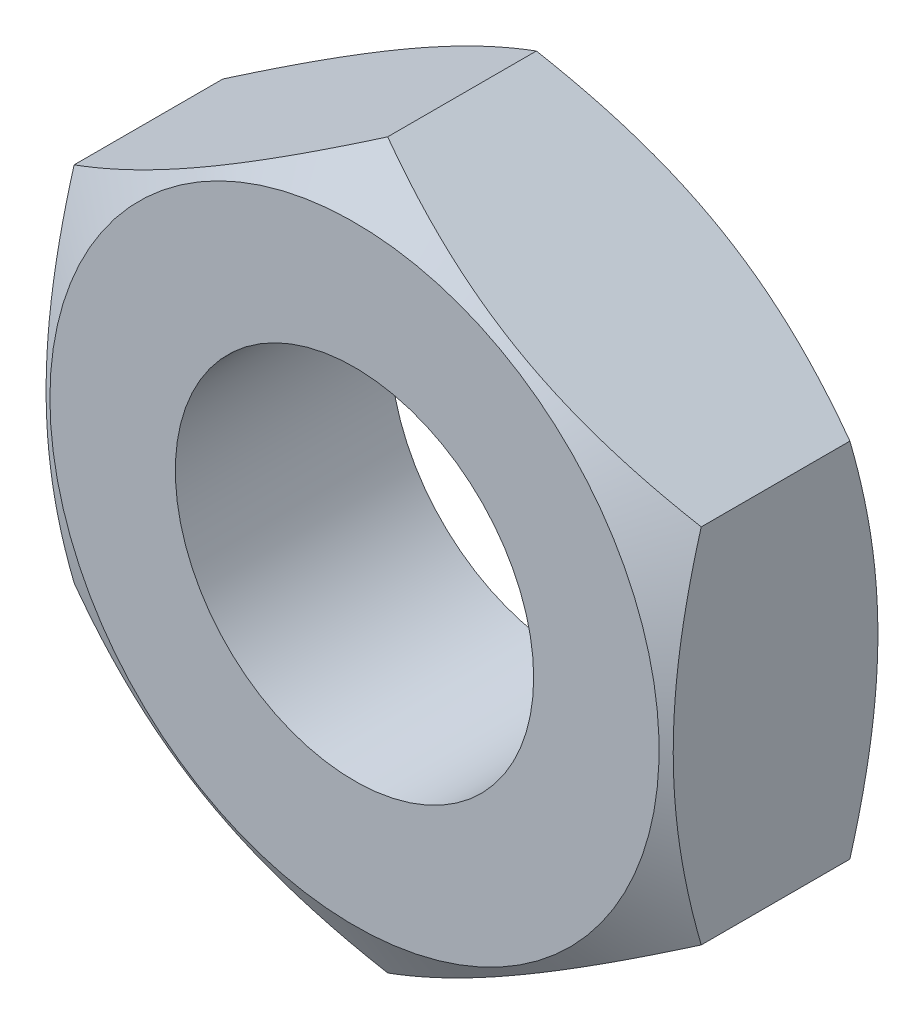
ISO-10303-21;
HEADER;
FILE_DESCRIPTION(('STEP AP214'),'2;1');
FILE_NAME('part.step','',(''),(''),'','','');
FILE_SCHEMA(('AUTOMOTIVE_DESIGN { 1 0 10303 214 1 1 1 1 }'));
ENDSEC;
DATA;
#1=APPLICATION_CONTEXT('core data for automotive mechanical design processes');
#2=APPLICATION_PROTOCOL_DEFINITION('international standard','automotive_design',2000,#1);
#3=PRODUCT_CONTEXT('',#1,'mechanical');
#4=PRODUCT('Part','Part','',(#3));
#5=PRODUCT_RELATED_PRODUCT_CATEGORY('part','',(#4));
#6=PRODUCT_DEFINITION_FORMATION('','',#4);
#7=PRODUCT_DEFINITION_CONTEXT('part definition',#1,'design');
#8=PRODUCT_DEFINITION('design','',#6,#7);
#9=PRODUCT_DEFINITION_SHAPE('','',#8);
#10=(LENGTH_UNIT() NAMED_UNIT(*) SI_UNIT(.MILLI.,.METRE.));
#11=(NAMED_UNIT(*) PLANE_ANGLE_UNIT() SI_UNIT($,.RADIAN.));
#12=(NAMED_UNIT(*) SI_UNIT($,.STERADIAN.) SOLID_ANGLE_UNIT());
#13=UNCERTAINTY_MEASURE_WITH_UNIT(LENGTH_MEASURE(1.E-05),#10,'distance_accuracy_value','');
#14=(GEOMETRIC_REPRESENTATION_CONTEXT(3) GLOBAL_UNCERTAINTY_ASSIGNED_CONTEXT((#13)) GLOBAL_UNIT_ASSIGNED_CONTEXT((#10,
#11,#12)) REPRESENTATION_CONTEXT('',''));
#15=CARTESIAN_POINT('',(0.,0.,0.));
#16=DIRECTION('',(0.,0.,1.));
#17=DIRECTION('',(1.,0.,0.));
#18=AXIS2_PLACEMENT_3D('',#15,#16,#17);
#19=CARTESIAN_POINT('',(0.,4.04145188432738,2.4));
#20=DIRECTION('',(0.,0.,1.));
#21=DIRECTION('',(1.,0.,0.));
#22=AXIS2_PLACEMENT_3D('',#19,#20,#21);
#23=PLANE('',#22);
#24=CARTESIAN_POINT('',(0.,0.,2.4));
#25=DIRECTION('',(0.,0.,-1.));
#26=DIRECTION('',(-1.,0.,0.));
#27=AXIS2_PLACEMENT_3D('',#24,#25,#26);
#28=CIRCLE('',#27,3.4);
#29=CARTESIAN_POINT('',(-3.4,0.,2.4));
#30=VERTEX_POINT('',#29);
#31=EDGE_CURVE('E222',#30,#30,#28,.T.);
#32=ORIENTED_EDGE('',*,*,#31,.F.);
#33=EDGE_LOOP('',(#32));
#34=FACE_BOUND('',#33,.T.);
#35=CARTESIAN_POINT('',(0.,0.,2.4));
#36=DIRECTION('',(0.,0.,1.));
#37=DIRECTION('',(1.,0.,0.));
#38=AXIS2_PLACEMENT_3D('',#35,#36,#37);
#39=CIRCLE('',#38,2.);
#40=CARTESIAN_POINT('',(2.,0.,2.4));
#41=VERTEX_POINT('',#40);
#42=EDGE_CURVE('E93',#41,#41,#39,.T.);
#43=ORIENTED_EDGE('',*,*,#42,.F.);
#44=EDGE_LOOP('',(#43));
#45=FACE_BOUND('',#44,.T.);
#46=ADVANCED_FACE('F14',(#34,#45),#23,.T.);
#47=CARTESIAN_POINT('',(0.,4.04145188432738,0.));
#48=DIRECTION('',(0.,0.,1.));
#49=DIRECTION('',(1.,0.,0.));
#50=AXIS2_PLACEMENT_3D('',#47,#48,#49);
#51=PLANE('',#50);
#52=CARTESIAN_POINT('',(0.,0.,0.));
#53=DIRECTION('',(0.,0.,-1.));
#54=DIRECTION('',(-1.,0.,0.));
#55=AXIS2_PLACEMENT_3D('',#52,#53,#54);
#56=CIRCLE('',#55,3.4);
#57=CARTESIAN_POINT('',(-3.4,0.,0.));
#58=VERTEX_POINT('',#57);
#59=EDGE_CURVE('E86',#58,#58,#56,.T.);
#60=ORIENTED_EDGE('',*,*,#59,.T.);
#61=EDGE_LOOP('',(#60));
#62=FACE_BOUND('',#61,.T.);
#63=CARTESIAN_POINT('',(0.,0.,0.));
#64=DIRECTION('',(0.,0.,1.));
#65=DIRECTION('',(1.,0.,0.));
#66=AXIS2_PLACEMENT_3D('',#63,#64,#65);
#67=CIRCLE('',#66,2.);
#68=CARTESIAN_POINT('',(2.,0.,0.));
#69=VERTEX_POINT('',#68);
#70=EDGE_CURVE('E198',#69,#69,#67,.T.);
#71=ORIENTED_EDGE('',*,*,#70,.T.);
#72=EDGE_LOOP('',(#71));
#73=FACE_BOUND('',#72,.T.);
#74=ADVANCED_FACE('F117',(#62,#73),#51,.F.);
#75=CARTESIAN_POINT('',(3.5,2.02072594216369,2.4));
#76=DIRECTION('',(-0.5,-0.866025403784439,0.));
#77=DIRECTION('',(0.866025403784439,-0.5,0.));
#78=AXIS2_PLACEMENT_3D('',#75,#76,#77);
#79=PLANE('',#78);
#80=DIRECTION('',(0.,0.,-1.));
#81=VECTOR('',#80,1.);
#82=CARTESIAN_POINT('',(3.5,2.02072594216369,2.4));
#83=LINE('',#82,#81);
#84=CARTESIAN_POINT('',(3.5,2.02072594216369,2.0296575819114));
#85=VERTEX_POINT('',#84);
#86=CARTESIAN_POINT('',(3.5,2.02072594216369,0.370342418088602));
#87=VERTEX_POINT('',#86);
#88=EDGE_CURVE('E89',#85,#87,#83,.T.);
#89=ORIENTED_EDGE('',*,*,#88,.T.);
#90=CARTESIAN_POINT('',(3.5002,2.02061047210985,0.37040908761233));
#91=CARTESIAN_POINT('',(3.34639282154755,2.10941108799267,0.319120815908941));
#92=CARTESIAN_POINT('',(3.19125798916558,2.19897822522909,0.272475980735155));
#93=CARTESIAN_POINT('',(2.87830199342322,2.37966345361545,0.191056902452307));
#94=CARTESIAN_POINT('',(2.72047526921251,2.47078475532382,0.15631146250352));
#95=CARTESIAN_POINT('',(2.40677778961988,2.65189807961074,0.102225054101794));
#96=CARTESIAN_POINT('',(2.25095530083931,2.74186223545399,0.082524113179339));
#97=CARTESIAN_POINT('',(1.93857711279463,2.92221386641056,0.0590051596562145));
#98=CARTESIAN_POINT('',(1.78202254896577,3.01260068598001,0.0551676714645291));
#99=CARTESIAN_POINT('',(1.48949078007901,3.1814939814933,0.0631503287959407));
#100=CARTESIAN_POINT('',(1.3534697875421,3.26002573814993,0.0730104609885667));
#101=CARTESIAN_POINT('',(1.08231397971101,3.41657761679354,0.104261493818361));
#102=CARTESIAN_POINT('',(0.947180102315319,3.49459719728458,0.125663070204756));
#103=CARTESIAN_POINT('',(0.675465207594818,3.65147186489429,0.179165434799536));
#104=CARTESIAN_POINT('',(0.538918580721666,3.73030709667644,0.211493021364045));
#105=CARTESIAN_POINT('',(0.2678619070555,3.88680174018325,0.284863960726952));
#106=CARTESIAN_POINT('',(0.133348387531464,3.96446315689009,0.325890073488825));
#107=CARTESIAN_POINT('',(-0.000199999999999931,4.04156735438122,0.37040908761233));
#108=B_SPLINE_CURVE_WITH_KNOTS('',3,(#90,#91,#92,#93,#94,#95,#96,#97,#98,#99,#100,#101,#102,
#103,#104,#105,#106,#107),.UNSPECIFIED.,.F.,.F.,(4,2,2,2,2,2,2,2,4),(0.,0.554793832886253,
1.11092123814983,1.65328467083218,2.19498204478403,2.6666513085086,3.13875761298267,
3.62133612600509,4.10296698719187),.UNSPECIFIED.);
#109=CARTESIAN_POINT('',(0.,4.04145188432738,0.370342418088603));
#110=VERTEX_POINT('',#109);
#111=EDGE_CURVE('E36',#87,#110,#108,.T.);
#112=ORIENTED_EDGE('',*,*,#111,.T.);
#113=DIRECTION('',(0.,0.,-1.));
#114=VECTOR('',#113,1.);
#115=CARTESIAN_POINT('',(0.,4.04145188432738,2.4));
#116=LINE('',#115,#114);
#117=CARTESIAN_POINT('',(0.,4.04145188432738,2.0296575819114));
#118=VERTEX_POINT('',#117);
#119=EDGE_CURVE('E102',#118,#110,#116,.T.);
#120=ORIENTED_EDGE('',*,*,#119,.F.);
#121=CARTESIAN_POINT('',(-0.0002,4.04156735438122,2.02959091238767));
#122=CARTESIAN_POINT('',(0.15360717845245,3.9527667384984,2.08087918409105));
#123=CARTESIAN_POINT('',(0.308742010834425,3.86319960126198,2.12752401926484));
#124=CARTESIAN_POINT('',(0.621698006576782,3.68251437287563,2.20894309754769));
#125=CARTESIAN_POINT('',(0.779524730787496,3.59139307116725,2.24368853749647));
#126=CARTESIAN_POINT('',(1.09322221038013,3.41027974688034,2.2977749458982));
#127=CARTESIAN_POINT('',(1.24904469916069,3.32031559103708,2.31747588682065));
#128=CARTESIAN_POINT('',(1.56142288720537,3.13996396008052,2.34099484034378));
#129=CARTESIAN_POINT('',(1.71797745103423,3.04957714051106,2.34483232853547));
#130=CARTESIAN_POINT('',(2.01050921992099,2.88068384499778,2.33684967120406));
#131=CARTESIAN_POINT('',(2.1465302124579,2.80215208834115,2.32698953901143));
#132=CARTESIAN_POINT('',(2.41768602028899,2.64560020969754,2.29573850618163));
#133=CARTESIAN_POINT('',(2.55281989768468,2.5675806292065,2.27433692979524));
#134=CARTESIAN_POINT('',(2.82453479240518,2.41070596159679,2.22083456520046));
#135=CARTESIAN_POINT('',(2.96108141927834,2.33187072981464,2.18850697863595));
#136=CARTESIAN_POINT('',(3.2321380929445,2.17537608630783,2.11513603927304));
#137=CARTESIAN_POINT('',(3.36665161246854,2.09771466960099,2.07410992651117));
#138=CARTESIAN_POINT('',(3.5002,2.02061047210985,2.02959091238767));
#139=B_SPLINE_CURVE_WITH_KNOTS('',3,(#121,#122,#123,#124,#125,#126,#127,#128,#129,#130,#131,
#132,#133,#134,#135,#136,#137,#138),.UNSPECIFIED.,.F.,.F.,(4,2,2,2,2,2,2,2,4),(0.,
0.554793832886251,1.11092123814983,1.65328467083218,2.19498204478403,2.66665130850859,
3.13875761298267,3.62133612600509,4.10296698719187),.UNSPECIFIED.);
#140=EDGE_CURVE('E186',#118,#85,#139,.T.);
#141=ORIENTED_EDGE('',*,*,#140,.T.);
#142=EDGE_LOOP('',(#89,#112,#120,#141));
#143=FACE_BOUND('',#142,.T.);
#144=ADVANCED_FACE('F16',(#143),#79,.F.);
#145=CARTESIAN_POINT('',(0.,4.04145188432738,2.4));
#146=DIRECTION('',(0.5,-0.866025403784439,0.));
#147=DIRECTION('',(0.866025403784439,0.5,0.));
#148=AXIS2_PLACEMENT_3D('',#145,#146,#147);
#149=PLANE('',#148);
#150=ORIENTED_EDGE('',*,*,#119,.T.);
#151=CARTESIAN_POINT('',(0.000200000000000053,4.04156735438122,0.37040908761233));
#152=CARTESIAN_POINT('',(-0.15360717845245,3.9527667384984,0.319120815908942));
#153=CARTESIAN_POINT('',(-0.308742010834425,3.86319960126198,0.272475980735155));
#154=CARTESIAN_POINT('',(-0.621698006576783,3.68251437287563,0.191056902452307));
#155=CARTESIAN_POINT('',(-0.779524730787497,3.59139307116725,0.15631146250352));
#156=CARTESIAN_POINT('',(-1.09322221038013,3.41027974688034,0.102225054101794));
#157=CARTESIAN_POINT('',(-1.24904469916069,3.32031559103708,0.0825241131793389));
#158=CARTESIAN_POINT('',(-1.56142288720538,3.13996396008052,0.0590051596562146));
#159=CARTESIAN_POINT('',(-1.71797745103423,3.04957714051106,0.0551676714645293));
#160=CARTESIAN_POINT('',(-2.01050921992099,2.88068384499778,0.0631503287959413));
#161=CARTESIAN_POINT('',(-2.14653021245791,2.80215208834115,0.0730104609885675));
#162=CARTESIAN_POINT('',(-2.417686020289,2.64560020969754,0.104261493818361));
#163=CARTESIAN_POINT('',(-2.55281989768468,2.5675806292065,0.125663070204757));
#164=CARTESIAN_POINT('',(-2.82453479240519,2.41070596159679,0.179165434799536));
#165=CARTESIAN_POINT('',(-2.96108141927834,2.33187072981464,0.211493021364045));
#166=CARTESIAN_POINT('',(-3.2321380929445,2.17537608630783,0.284863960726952));
#167=CARTESIAN_POINT('',(-3.36665161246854,2.09771466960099,0.325890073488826));
#168=CARTESIAN_POINT('',(-3.5002,2.02061047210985,0.370409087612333));
#169=B_SPLINE_CURVE_WITH_KNOTS('',3,(#151,#152,#153,#154,#155,#156,#157,#158,#159,#160,#161,
#162,#163,#164,#165,#166,#167,#168),.UNSPECIFIED.,.F.,.F.,(4,2,2,2,2,2,2,2,4),(0.,
0.554793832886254,1.11092123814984,1.65328467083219,2.19498204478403,2.6666513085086,
3.13875761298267,3.6213361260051,4.10296698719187),.UNSPECIFIED.);
#170=CARTESIAN_POINT('',(-3.5,2.02072594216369,0.370342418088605));
#171=VERTEX_POINT('',#170);
#172=EDGE_CURVE('E160',#110,#171,#169,.T.);
#173=ORIENTED_EDGE('',*,*,#172,.T.);
#174=DIRECTION('',(0.,0.,-1.));
#175=VECTOR('',#174,1.);
#176=CARTESIAN_POINT('',(-3.5,2.02072594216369,2.4));
#177=LINE('',#176,#175);
#178=CARTESIAN_POINT('',(-3.5,2.02072594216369,2.0296575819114));
#179=VERTEX_POINT('',#178);
#180=EDGE_CURVE('E99',#179,#171,#177,.T.);
#181=ORIENTED_EDGE('',*,*,#180,.F.);
#182=CARTESIAN_POINT('',(-3.5002,2.02061047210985,2.02959091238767));
#183=CARTESIAN_POINT('',(-3.34639282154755,2.10941108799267,2.08087918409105));
#184=CARTESIAN_POINT('',(-3.19125798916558,2.19897822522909,2.12752401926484));
#185=CARTESIAN_POINT('',(-2.87830199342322,2.37966345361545,2.20894309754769));
#186=CARTESIAN_POINT('',(-2.72047526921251,2.47078475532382,2.24368853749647));
#187=CARTESIAN_POINT('',(-2.40677778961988,2.65189807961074,2.2977749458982));
#188=CARTESIAN_POINT('',(-2.25095530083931,2.74186223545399,2.31747588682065));
#189=CARTESIAN_POINT('',(-1.93857711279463,2.92221386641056,2.34099484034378));
#190=CARTESIAN_POINT('',(-1.78202254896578,3.01260068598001,2.34483232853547));
#191=CARTESIAN_POINT('',(-1.48949078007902,3.1814939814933,2.33684967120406));
#192=CARTESIAN_POINT('',(-1.3534697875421,3.26002573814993,2.32698953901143));
#193=CARTESIAN_POINT('',(-1.08231397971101,3.41657761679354,2.29573850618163));
#194=CARTESIAN_POINT('',(-0.947180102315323,3.49459719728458,2.27433692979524));
#195=CARTESIAN_POINT('',(-0.675465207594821,3.65147186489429,2.22083456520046));
#196=CARTESIAN_POINT('',(-0.538918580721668,3.73030709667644,2.18850697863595));
#197=CARTESIAN_POINT('',(-0.267861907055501,3.88680174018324,2.11513603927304));
#198=CARTESIAN_POINT('',(-0.133348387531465,3.96446315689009,2.07410992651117));
#199=CARTESIAN_POINT('',(0.000200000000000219,4.04156735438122,2.02959091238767));
#200=B_SPLINE_CURVE_WITH_KNOTS('',3,(#182,#183,#184,#185,#186,#187,#188,#189,#190,#191,#192,
#193,#194,#195,#196,#197,#198,#199),.UNSPECIFIED.,.F.,.F.,(4,2,2,2,2,2,2,2,4),(0.,
0.554793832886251,1.11092123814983,1.65328467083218,2.19498204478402,2.66665130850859,
3.13875761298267,3.62133612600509,4.10296698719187),.UNSPECIFIED.);
#201=EDGE_CURVE('E178',#179,#118,#200,.T.);
#202=ORIENTED_EDGE('',*,*,#201,.T.);
#203=EDGE_LOOP('',(#150,#173,#181,#202));
#204=FACE_BOUND('',#203,.T.);
#205=ADVANCED_FACE('F170',(#204),#149,.F.);
#206=CARTESIAN_POINT('',(-3.5,2.02072594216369,2.4));
#207=DIRECTION('',(1.,0.,0.));
#208=DIRECTION('',(0.,1.,0.));
#209=AXIS2_PLACEMENT_3D('',#206,#207,#208);
#210=PLANE('',#209);
#211=ORIENTED_EDGE('',*,*,#180,.T.);
#212=CARTESIAN_POINT('',(-3.5,-5.41189138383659,1.75805590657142));
#213=CARTESIAN_POINT('',(-3.5,-5.25915719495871,1.6840307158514));
#214=CARTESIAN_POINT('',(-3.49999999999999,-5.10607066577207,1.61071996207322));
#215=CARTESIAN_POINT('',(-3.49999999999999,-4.79900549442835,1.46592946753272));
#216=CARTESIAN_POINT('',(-3.49999999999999,-4.64502671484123,1.39445001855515));
#217=CARTESIAN_POINT('',(-3.49999999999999,-4.33518854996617,1.25336122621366));
#218=CARTESIAN_POINT('',(-3.49999999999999,-4.17932347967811,1.18376432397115));
#219=CARTESIAN_POINT('',(-3.49999999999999,-3.86634801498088,1.04744015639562));
#220=CARTESIAN_POINT('',(-3.5,-3.70923768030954,0.980712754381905));
#221=CARTESIAN_POINT('',(-3.5,-3.38851244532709,0.8488257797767));
#222=CARTESIAN_POINT('',(-3.5,-3.22484925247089,0.783783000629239));
#223=CARTESIAN_POINT('',(-3.5,-2.89560216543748,0.658659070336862));
#224=CARTESIAN_POINT('',(-3.5,-2.73001805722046,0.598578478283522));
#225=CARTESIAN_POINT('',(-3.5,-2.39698090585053,0.484967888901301));
#226=CARTESIAN_POINT('',(-3.5,-2.22953248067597,0.431424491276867));
#227=CARTESIAN_POINT('',(-3.5,-1.89223377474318,0.33261702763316));
#228=CARTESIAN_POINT('',(-3.5,-1.72238427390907,0.287350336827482));
#229=CARTESIAN_POINT('',(-3.5,-1.38112705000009,0.20751923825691));
#230=CARTESIAN_POINT('',(-3.5,-1.20973301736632,0.172897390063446));
#231=CARTESIAN_POINT('',(-3.5,-0.864830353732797,0.116323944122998));
#232=CARTESIAN_POINT('',(-3.5,-0.691321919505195,0.0943711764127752));
#233=CARTESIAN_POINT('',(-3.5,-0.345316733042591,0.0651748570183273));
#234=CARTESIAN_POINT('',(-3.5,-0.172836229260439,0.0577434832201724));
#235=CARTESIAN_POINT('',(-3.5,0.172139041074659,0.0577265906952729));
#236=CARTESIAN_POINT('',(-3.5,0.344633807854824,0.0651413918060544));
#237=CARTESIAN_POINT('',(-3.5,0.637955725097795,0.0898510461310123));
#238=CARTESIAN_POINT('',(-3.5,0.759098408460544,0.10361029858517));
#239=CARTESIAN_POINT('',(-3.5,1.00048112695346,0.137585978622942));
#240=CARTESIAN_POINT('',(-3.5,1.12072103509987,0.157803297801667));
#241=CARTESIAN_POINT('',(-3.5,1.4799354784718,0.227078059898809));
#242=CARTESIAN_POINT('',(-3.5,1.71726727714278,0.284745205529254));
#243=CARTESIAN_POINT('',(-3.5,2.0721213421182,0.384539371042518));
#244=CARTESIAN_POINT('',(-3.5,2.19148815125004,0.420479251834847));
#245=CARTESIAN_POINT('',(-3.5,2.4290618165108,0.496041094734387));
#246=CARTESIAN_POINT('',(-3.5,2.54726866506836,0.535663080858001));
#247=CARTESIAN_POINT('',(-3.5,2.7825608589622,0.61795752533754));
#248=CARTESIAN_POINT('',(-3.5,2.89964657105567,0.660628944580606));
#249=CARTESIAN_POINT('',(-3.5,3.13285133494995,0.748525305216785));
#250=CARTESIAN_POINT('',(-3.5,3.24897039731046,0.793750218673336));
#251=CARTESIAN_POINT('',(-3.5,3.5198670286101,0.902140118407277));
#252=CARTESIAN_POINT('',(-3.5,3.67430308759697,0.966156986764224));
#253=CARTESIAN_POINT('',(-3.5,3.98188794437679,1.09722011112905));
#254=CARTESIAN_POINT('',(-3.5,4.13503666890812,1.1642665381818));
#255=CARTESIAN_POINT('',(-3.5,4.44028010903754,1.30078852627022));
#256=CARTESIAN_POINT('',(-3.5,4.59237461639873,1.37026455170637));
#257=CARTESIAN_POINT('',(-3.5,4.89565744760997,1.51116997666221));
#258=CARTESIAN_POINT('',(-3.5,5.04684575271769,1.58259941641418));
#259=CARTESIAN_POINT('',(-3.5,5.49956245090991,1.79939263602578));
#260=CARTESIAN_POINT('',(-3.5,5.79995345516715,1.94713021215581));
#261=CARTESIAN_POINT('',(-3.5,6.39857965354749,2.24690868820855));
#262=CARTESIAN_POINT('',(-3.5,6.69681477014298,2.39894974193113));
#263=CARTESIAN_POINT('',(-3.5,7.26724667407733,2.69347344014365));
#264=CARTESIAN_POINT('',(-3.5,7.53956850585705,2.83571434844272));
#265=CARTESIAN_POINT('',(-3.5,8.08319672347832,3.12214237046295));
#266=CARTESIAN_POINT('',(-3.50000000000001,8.35450307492,3.26632954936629));
#267=CARTESIAN_POINT('',(-3.50000000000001,8.89566817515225,3.55584207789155));
#268=CARTESIAN_POINT('',(-3.50000000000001,9.16552883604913,3.7011638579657));
#269=CARTESIAN_POINT('',(-3.50000000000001,9.70459895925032,3.99297655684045));
#270=CARTESIAN_POINT('',(-3.5,9.97380845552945,4.13946741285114));
#271=CARTESIAN_POINT('',(-3.5,10.2427774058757,4.28639542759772));
#272=B_SPLINE_CURVE_WITH_KNOTS('',3,(#212,#213,#214,#215,#216,#217,#218,#219,#220,#221,#222,
#223,#224,#225,#226,#227,#228,#229,#230,#231,#232,#233,#234,#235,#236,#237,#238,#239,#240,#241,
#242,#243,#244,#245,#246,#247,#248,#249,#250,#251,#252,#253,#254,#255,#256,#257,#258,#259,#260,
#261,#262,#263,#264,#265,#266,#267,#268,#269,#270,#271),.UNSPECIFIED.,.F.,.F.,(4,2,2,2,2,2,2,2,
2,2,2,2,2,2,2,2,2,2,2,2,2,2,2,2,2,2,2,2,2,4),(0.,0.509189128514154,1.01845888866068,
1.53052834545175,2.04257338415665,2.57085374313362,3.09919354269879,3.62643146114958,
4.15350188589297,4.67767615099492,5.20180200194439,5.71910263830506,6.23641441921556,
6.60200141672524,6.96763890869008,7.69932625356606,8.07327517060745,8.44722652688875,
8.82105105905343,9.1948715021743,9.6963637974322,10.197884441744,10.6995014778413,
11.2011288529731,12.2053358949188,13.2095788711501,14.1312652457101,15.0529825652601,
15.9724840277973,16.8919364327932),.UNSPECIFIED.);
#273=CARTESIAN_POINT('',(-3.5,-2.02072594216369,0.370342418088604));
#274=VERTEX_POINT('',#273);
#275=EDGE_CURVE('E154',#171,#274,#272,.F.);
#276=ORIENTED_EDGE('',*,*,#275,.T.);
#277=DIRECTION('',(0.,0.,-1.));
#278=VECTOR('',#277,1.);
#279=CARTESIAN_POINT('',(-3.5,-2.02072594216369,2.4));
#280=LINE('',#279,#278);
#281=CARTESIAN_POINT('',(-3.5,-2.02072594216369,2.0296575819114));
#282=VERTEX_POINT('',#281);
#283=EDGE_CURVE('E91',#282,#274,#280,.T.);
#284=ORIENTED_EDGE('',*,*,#283,.F.);
#285=CARTESIAN_POINT('',(-3.5,-5.41189138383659,0.641944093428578));
#286=CARTESIAN_POINT('',(-3.5,-5.2591571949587,0.715969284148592));
#287=CARTESIAN_POINT('',(-3.49999999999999,-5.10607066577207,0.789280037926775));
#288=CARTESIAN_POINT('',(-3.49999999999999,-4.79900549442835,0.934070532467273));
#289=CARTESIAN_POINT('',(-3.49999999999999,-4.64502671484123,1.00554998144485));
#290=CARTESIAN_POINT('',(-3.49999999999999,-4.33518854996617,1.14663877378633));
#291=CARTESIAN_POINT('',(-3.49999999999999,-4.17932347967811,1.21623567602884));
#292=CARTESIAN_POINT('',(-3.49999999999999,-3.86634801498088,1.35255984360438));
#293=CARTESIAN_POINT('',(-3.5,-3.70923768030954,1.41928724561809));
#294=CARTESIAN_POINT('',(-3.5,-3.38851244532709,1.5511742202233));
#295=CARTESIAN_POINT('',(-3.5,-3.22484925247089,1.61621699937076));
#296=CARTESIAN_POINT('',(-3.5,-2.89560216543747,1.74134092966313));
#297=CARTESIAN_POINT('',(-3.5,-2.73001805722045,1.80142152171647));
#298=CARTESIAN_POINT('',(-3.5,-2.39698090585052,1.91503211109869));
#299=CARTESIAN_POINT('',(-3.5,-2.22953248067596,1.96857550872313));
#300=CARTESIAN_POINT('',(-3.5,-1.89223377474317,2.06738297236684));
#301=CARTESIAN_POINT('',(-3.5,-1.72238427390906,2.11264966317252));
#302=CARTESIAN_POINT('',(-3.5,-1.38112705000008,2.19248076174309));
#303=CARTESIAN_POINT('',(-3.5,-1.20973301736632,2.22710260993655));
#304=CARTESIAN_POINT('',(-3.5,-0.864830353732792,2.283676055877));
#305=CARTESIAN_POINT('',(-3.5,-0.691321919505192,2.30562882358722));
#306=CARTESIAN_POINT('',(-3.5,-0.345316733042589,2.33482514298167));
#307=CARTESIAN_POINT('',(-3.5,-0.172836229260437,2.34225651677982));
#308=CARTESIAN_POINT('',(-3.5,0.17213904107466,2.34227340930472));
#309=CARTESIAN_POINT('',(-3.5,0.344633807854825,2.33485860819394));
#310=CARTESIAN_POINT('',(-3.5,0.637955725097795,2.31014895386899));
#311=CARTESIAN_POINT('',(-3.5,0.759098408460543,2.29638970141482));
#312=CARTESIAN_POINT('',(-3.5,1.00048112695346,2.26241402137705));
#313=CARTESIAN_POINT('',(-3.5,1.12072103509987,2.24219670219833));
#314=CARTESIAN_POINT('',(-3.5,1.4799354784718,2.17292194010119));
#315=CARTESIAN_POINT('',(-3.5,1.71726727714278,2.11525479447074));
#316=CARTESIAN_POINT('',(-3.5,2.0721213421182,2.01546062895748));
#317=CARTESIAN_POINT('',(-3.5,2.19148815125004,1.97952074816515));
#318=CARTESIAN_POINT('',(-3.5,2.4290618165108,1.90395890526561));
#319=CARTESIAN_POINT('',(-3.5,2.54726866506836,1.86433691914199));
#320=CARTESIAN_POINT('',(-3.5,2.7825608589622,1.78204247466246));
#321=CARTESIAN_POINT('',(-3.5,2.89964657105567,1.73937105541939));
#322=CARTESIAN_POINT('',(-3.5,3.13285133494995,1.65147469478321));
#323=CARTESIAN_POINT('',(-3.5,3.24897039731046,1.60624978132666));
#324=CARTESIAN_POINT('',(-3.5,3.5198670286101,1.49785988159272));
#325=CARTESIAN_POINT('',(-3.5,3.67430308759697,1.43384301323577));
#326=CARTESIAN_POINT('',(-3.5,3.98188794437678,1.30277988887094));
#327=CARTESIAN_POINT('',(-3.5,4.13503666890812,1.23573346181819));
#328=CARTESIAN_POINT('',(-3.5,4.44028010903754,1.09921147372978));
#329=CARTESIAN_POINT('',(-3.5,4.59237461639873,1.02973544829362));
#330=CARTESIAN_POINT('',(-3.5,4.89565744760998,0.88883002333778));
#331=CARTESIAN_POINT('',(-3.5,5.04684575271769,0.817400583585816));
#332=CARTESIAN_POINT('',(-3.5,5.49956245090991,0.600607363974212));
#333=CARTESIAN_POINT('',(-3.5,5.79995345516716,0.452869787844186));
#334=CARTESIAN_POINT('',(-3.5,6.39857965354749,0.153091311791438));
#335=CARTESIAN_POINT('',(-3.5,6.69681477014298,0.00105025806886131));
#336=CARTESIAN_POINT('',(-3.5,7.26724667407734,-0.293473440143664));
#337=CARTESIAN_POINT('',(-3.5,7.53956850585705,-0.435714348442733));
#338=CARTESIAN_POINT('',(-3.5,8.08319672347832,-0.722142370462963));
#339=CARTESIAN_POINT('',(-3.50000000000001,8.35450307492,-0.8663295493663));
#340=CARTESIAN_POINT('',(-3.50000000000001,8.89566817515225,-1.15584207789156));
#341=CARTESIAN_POINT('',(-3.50000000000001,9.16552883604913,-1.30116385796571));
#342=CARTESIAN_POINT('',(-3.50000000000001,9.70459895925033,-1.59297655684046));
#343=CARTESIAN_POINT('',(-3.5,9.97380845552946,-1.73946741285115));
#344=CARTESIAN_POINT('',(-3.5,10.2427774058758,-1.88639542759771));
#345=B_SPLINE_CURVE_WITH_KNOTS('',3,(#285,#286,#287,#288,#289,#290,#291,#292,#293,#294,#295,
#296,#297,#298,#299,#300,#301,#302,#303,#304,#305,#306,#307,#308,#309,#310,#311,#312,#313,#314,
#315,#316,#317,#318,#319,#320,#321,#322,#323,#324,#325,#326,#327,#328,#329,#330,#331,#332,#333,
#334,#335,#336,#337,#338,#339,#340,#341,#342,#343,#344),.UNSPECIFIED.,.F.,.F.,(4,2,2,2,2,2,2,2,
2,2,2,2,2,2,2,2,2,2,2,2,2,2,2,2,2,2,2,2,2,4),(0.,0.509189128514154,1.01845888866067,
1.53052834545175,2.04257338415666,2.57085374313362,3.0991935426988,3.62643146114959,
4.15350188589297,4.67767615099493,5.20180200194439,5.71910263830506,6.23641441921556,
6.60200141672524,6.96763890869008,7.69932625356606,8.07327517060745,8.44722652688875,
8.82105105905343,9.1948715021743,9.6963637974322,10.197884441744,10.6995014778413,
11.2011288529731,12.2053358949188,13.2095788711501,14.1312652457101,15.0529825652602,
15.9724840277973,16.8919364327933),.UNSPECIFIED.);
#346=EDGE_CURVE('E187',#282,#179,#345,.T.);
#347=ORIENTED_EDGE('',*,*,#346,.T.);
#348=EDGE_LOOP('',(#211,#276,#284,#347));
#349=FACE_BOUND('',#348,.T.);
#350=ADVANCED_FACE('F173',(#349),#210,.F.);
#351=CARTESIAN_POINT('',(-3.5,-2.02072594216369,2.4));
#352=DIRECTION('',(0.5,0.866025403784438,0.));
#353=DIRECTION('',(-0.866025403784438,0.5,0.));
#354=AXIS2_PLACEMENT_3D('',#351,#352,#353);
#355=PLANE('',#354);
#356=ORIENTED_EDGE('',*,*,#283,.T.);
#357=CARTESIAN_POINT('',(-3.5002,-2.02061047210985,0.370409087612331));
#358=CARTESIAN_POINT('',(-3.34639282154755,-2.10941108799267,0.319120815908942));
#359=CARTESIAN_POINT('',(-3.19125798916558,-2.1989782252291,0.272475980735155));
#360=CARTESIAN_POINT('',(-2.87830199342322,-2.37966345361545,0.191056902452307));
#361=CARTESIAN_POINT('',(-2.72047526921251,-2.47078475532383,0.156311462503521));
#362=CARTESIAN_POINT('',(-2.40677778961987,-2.65189807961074,0.102225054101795));
#363=CARTESIAN_POINT('',(-2.25095530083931,-2.74186223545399,0.0825241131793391));
#364=CARTESIAN_POINT('',(-1.93857711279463,-2.92221386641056,0.0590051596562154));
#365=CARTESIAN_POINT('',(-1.78202254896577,-3.01260068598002,0.0551676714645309));
#366=CARTESIAN_POINT('',(-1.48949078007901,-3.1814939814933,0.0631503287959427));
#367=CARTESIAN_POINT('',(-1.3534697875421,-3.26002573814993,0.0730104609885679));
#368=CARTESIAN_POINT('',(-1.08231397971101,-3.41657761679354,0.104261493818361));
#369=CARTESIAN_POINT('',(-0.947180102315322,-3.49459719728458,0.125663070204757));
#370=CARTESIAN_POINT('',(-0.675465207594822,-3.65147186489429,0.179165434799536));
#371=CARTESIAN_POINT('',(-0.538918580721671,-3.73030709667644,0.211493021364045));
#372=CARTESIAN_POINT('',(-0.267861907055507,-3.88680174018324,0.284863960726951));
#373=CARTESIAN_POINT('',(-0.133348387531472,-3.96446315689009,0.325890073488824));
#374=CARTESIAN_POINT('',(0.000199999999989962,-4.04156735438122,0.37040908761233));
#375=B_SPLINE_CURVE_WITH_KNOTS('',3,(#357,#358,#359,#360,#361,#362,#363,#364,#365,#366,#367,
#368,#369,#370,#371,#372,#373,#374),.UNSPECIFIED.,.F.,.F.,(4,2,2,2,2,2,2,2,4),(0.,
0.554793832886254,1.11092123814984,1.65328467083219,2.19498204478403,2.6666513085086,
3.13875761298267,3.62133612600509,4.10296698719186),.UNSPECIFIED.);
#376=CARTESIAN_POINT('',(0.,-4.04145188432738,0.370342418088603));
#377=VERTEX_POINT('',#376);
#378=EDGE_CURVE('E85',#274,#377,#375,.T.);
#379=ORIENTED_EDGE('',*,*,#378,.T.);
#380=DIRECTION('',(0.,0.,-1.));
#381=VECTOR('',#380,1.);
#382=CARTESIAN_POINT('',(0.,-4.04145188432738,2.4));
#383=LINE('',#382,#381);
#384=CARTESIAN_POINT('',(0.,-4.04145188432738,2.0296575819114));
#385=VERTEX_POINT('',#384);
#386=EDGE_CURVE('E84',#385,#377,#383,.T.);
#387=ORIENTED_EDGE('',*,*,#386,.F.);
#388=CARTESIAN_POINT('',(0.000199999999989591,-4.04156735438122,2.02959091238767));
#389=CARTESIAN_POINT('',(-0.15360717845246,-3.9527667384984,2.08087918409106));
#390=CARTESIAN_POINT('',(-0.308742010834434,-3.86319960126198,2.12752401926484));
#391=CARTESIAN_POINT('',(-0.62169800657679,-3.68251437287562,2.20894309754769));
#392=CARTESIAN_POINT('',(-0.779524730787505,-3.59139307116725,2.24368853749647));
#393=CARTESIAN_POINT('',(-1.09322221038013,-3.41027974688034,2.2977749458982));
#394=CARTESIAN_POINT('',(-1.2490446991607,-3.32031559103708,2.31747588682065));
#395=CARTESIAN_POINT('',(-1.56142288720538,-3.13996396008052,2.34099484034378));
#396=CARTESIAN_POINT('',(-1.71797745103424,-3.04957714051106,2.34483232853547));
#397=CARTESIAN_POINT('',(-2.010509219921,-2.88068384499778,2.33684967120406));
#398=CARTESIAN_POINT('',(-2.14653021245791,-2.80215208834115,2.32698953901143));
#399=CARTESIAN_POINT('',(-2.417686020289,-2.64560020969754,2.29573850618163));
#400=CARTESIAN_POINT('',(-2.55281989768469,-2.5675806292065,2.27433692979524));
#401=CARTESIAN_POINT('',(-2.82453479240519,-2.41070596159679,2.22083456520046));
#402=CARTESIAN_POINT('',(-2.96108141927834,-2.33187072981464,2.18850697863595));
#403=CARTESIAN_POINT('',(-3.2321380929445,-2.17537608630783,2.11513603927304));
#404=CARTESIAN_POINT('',(-3.36665161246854,-2.09771466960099,2.07410992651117));
#405=CARTESIAN_POINT('',(-3.5002,-2.02061047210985,2.02959091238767));
#406=B_SPLINE_CURVE_WITH_KNOTS('',3,(#388,#389,#390,#391,#392,#393,#394,#395,#396,#397,#398,
#399,#400,#401,#402,#403,#404,#405),.UNSPECIFIED.,.F.,.F.,(4,2,2,2,2,2,2,2,4),(0.,
0.554793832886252,1.11092123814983,1.65328467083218,2.19498204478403,2.66665130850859,
3.13875761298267,3.62133612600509,4.10296698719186),.UNSPECIFIED.);
#407=EDGE_CURVE('E224',#385,#282,#406,.T.);
#408=ORIENTED_EDGE('',*,*,#407,.T.);
#409=EDGE_LOOP('',(#356,#379,#387,#408));
#410=FACE_BOUND('',#409,.T.);
#411=ADVANCED_FACE('F123',(#410),#355,.F.);
#412=CARTESIAN_POINT('',(0.,-4.04145188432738,2.4));
#413=DIRECTION('',(-0.5,0.866025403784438,0.));
#414=DIRECTION('',(-0.866025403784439,-0.5,0.));
#415=AXIS2_PLACEMENT_3D('',#412,#413,#414);
#416=PLANE('',#415);
#417=ORIENTED_EDGE('',*,*,#386,.T.);
#418=CARTESIAN_POINT('',(-0.000200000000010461,-4.04156735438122,0.37040908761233));
#419=CARTESIAN_POINT('',(0.153607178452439,-3.9527667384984,0.319120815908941));
#420=CARTESIAN_POINT('',(0.308742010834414,-3.86319960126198,0.272475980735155));
#421=CARTESIAN_POINT('',(0.621698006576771,-3.68251437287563,0.191056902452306));
#422=CARTESIAN_POINT('',(0.779524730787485,-3.59139307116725,0.156311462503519));
#423=CARTESIAN_POINT('',(1.09322221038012,-3.41027974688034,0.102225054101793));
#424=CARTESIAN_POINT('',(1.24904469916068,-3.32031559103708,0.0825241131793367));
#425=CARTESIAN_POINT('',(1.56142288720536,-3.13996396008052,0.0590051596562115));
#426=CARTESIAN_POINT('',(1.71797745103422,-3.04957714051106,0.0551676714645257));
#427=CARTESIAN_POINT('',(2.01050921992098,-2.88068384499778,0.0631503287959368));
#428=CARTESIAN_POINT('',(2.1465302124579,-2.80215208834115,0.0730104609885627));
#429=CARTESIAN_POINT('',(2.41768602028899,-2.64560020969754,0.104261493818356));
#430=CARTESIAN_POINT('',(2.55281989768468,-2.5675806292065,0.125663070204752));
#431=CARTESIAN_POINT('',(2.82453479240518,-2.41070596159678,0.179165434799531));
#432=CARTESIAN_POINT('',(2.96108141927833,-2.33187072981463,0.211493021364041));
#433=CARTESIAN_POINT('',(3.2321380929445,-2.17537608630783,0.284863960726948));
#434=CARTESIAN_POINT('',(3.36665161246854,-2.09771466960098,0.325890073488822));
#435=CARTESIAN_POINT('',(3.5002,-2.02061047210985,0.370409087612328));
#436=B_SPLINE_CURVE_WITH_KNOTS('',3,(#418,#419,#420,#421,#422,#423,#424,#425,#426,#427,#428,
#429,#430,#431,#432,#433,#434,#435),.UNSPECIFIED.,.F.,.F.,(4,2,2,2,2,2,2,2,4),(0.,
0.554793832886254,1.11092123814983,1.65328467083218,2.19498204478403,2.6666513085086,
3.13875761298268,3.6213361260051,4.10296698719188),.UNSPECIFIED.);
#437=CARTESIAN_POINT('',(3.5,-2.02072594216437,0.370342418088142));
#438=VERTEX_POINT('',#437);
#439=EDGE_CURVE('E72',#377,#438,#436,.T.);
#440=ORIENTED_EDGE('',*,*,#439,.T.);
#441=DIRECTION('',(0.,0.,-1.));
#442=VECTOR('',#441,1.);
#443=CARTESIAN_POINT('',(3.5,-2.02072594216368,2.4));
#444=LINE('',#443,#442);
#445=CARTESIAN_POINT('',(3.5,-2.02072594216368,2.0296575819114));
#446=VERTEX_POINT('',#445);
#447=EDGE_CURVE('E82',#446,#438,#444,.T.);
#448=ORIENTED_EDGE('',*,*,#447,.F.);
#449=CARTESIAN_POINT('',(3.5002,-2.02061047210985,2.02959091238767));
#450=CARTESIAN_POINT('',(3.34639282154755,-2.10941108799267,2.08087918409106));
#451=CARTESIAN_POINT('',(3.19125798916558,-2.19897822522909,2.12752401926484));
#452=CARTESIAN_POINT('',(2.87830199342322,-2.37966345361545,2.20894309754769));
#453=CARTESIAN_POINT('',(2.72047526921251,-2.47078475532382,2.24368853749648));
#454=CARTESIAN_POINT('',(2.40677778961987,-2.65189807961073,2.2977749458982));
#455=CARTESIAN_POINT('',(2.25095530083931,-2.74186223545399,2.31747588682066));
#456=CARTESIAN_POINT('',(1.93857711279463,-2.92221386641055,2.34099484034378));
#457=CARTESIAN_POINT('',(1.78202254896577,-3.01260068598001,2.34483232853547));
#458=CARTESIAN_POINT('',(1.48949078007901,-3.18149398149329,2.33684967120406));
#459=CARTESIAN_POINT('',(1.35346978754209,-3.26002573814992,2.32698953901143));
#460=CARTESIAN_POINT('',(1.082313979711,-3.41657761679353,2.29573850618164));
#461=CARTESIAN_POINT('',(0.947180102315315,-3.49459719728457,2.27433692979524));
#462=CARTESIAN_POINT('',(0.675465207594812,-3.65147186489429,2.22083456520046));
#463=CARTESIAN_POINT('',(0.53891858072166,-3.73030709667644,2.18850697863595));
#464=CARTESIAN_POINT('',(0.267861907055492,-3.88680174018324,2.11513603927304));
#465=CARTESIAN_POINT('',(0.133348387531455,-3.96446315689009,2.07410992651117));
#466=CARTESIAN_POINT('',(-0.000200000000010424,-4.04156735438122,2.02959091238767));
#467=B_SPLINE_CURVE_WITH_KNOTS('',3,(#449,#450,#451,#452,#453,#454,#455,#456,#457,#458,#459,
#460,#461,#462,#463,#464,#465,#466),.UNSPECIFIED.,.F.,.F.,(4,2,2,2,2,2,2,2,4),(0.,
0.554793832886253,1.11092123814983,1.65328467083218,2.19498204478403,2.6666513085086,
3.13875761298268,3.6213361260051,4.10296698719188),.UNSPECIFIED.);
#468=EDGE_CURVE('E43',#446,#385,#467,.T.);
#469=ORIENTED_EDGE('',*,*,#468,.T.);
#470=EDGE_LOOP('',(#417,#440,#448,#469));
#471=FACE_BOUND('',#470,.T.);
#472=ADVANCED_FACE('F81',(#471),#416,.F.);
#473=CARTESIAN_POINT('',(3.5,-2.02072594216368,2.4));
#474=DIRECTION('',(-1.,0.,0.));
#475=DIRECTION('',(0.,0.,1.));
#476=AXIS2_PLACEMENT_3D('',#473,#474,#475);
#477=PLANE('',#476);
#478=ORIENTED_EDGE('',*,*,#447,.T.);
#479=CARTESIAN_POINT('',(3.5,-5.41189138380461,1.75805590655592));
#480=CARTESIAN_POINT('',(3.5,-5.2591571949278,1.68403071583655));
#481=CARTESIAN_POINT('',(3.5,-5.10607066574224,1.61071996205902));
#482=CARTESIAN_POINT('',(3.5,-4.79900549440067,1.46592946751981));
#483=CARTESIAN_POINT('',(3.5,-4.64502671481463,1.39445001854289));
#484=CARTESIAN_POINT('',(3.5,-4.33518854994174,1.25336122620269));
#485=CARTESIAN_POINT('',(3.5,-4.17932347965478,1.18376432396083));
#486=CARTESIAN_POINT('',(3.5,-3.86634801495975,1.04744015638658));
#487=CARTESIAN_POINT('',(3.5,-3.70923768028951,0.9807127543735));
#488=CARTESIAN_POINT('',(3.5,-3.38851244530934,0.848825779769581));
#489=CARTESIAN_POINT('',(3.5,-3.22484925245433,0.783783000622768));
#490=CARTESIAN_POINT('',(3.5,-2.8956021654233,0.658659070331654));
#491=CARTESIAN_POINT('',(3.5,-2.73001805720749,0.598578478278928));
#492=CARTESIAN_POINT('',(3.5,-2.39698090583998,0.484967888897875));
#493=CARTESIAN_POINT('',(3.5,-2.22953248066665,0.431424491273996));
#494=CARTESIAN_POINT('',(3.5,-1.89223377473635,0.332617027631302));
#495=CARTESIAN_POINT('',(3.5,-1.72238427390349,0.287350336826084));
#496=CARTESIAN_POINT('',(3.5,-1.38112704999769,0.20751923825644));
#497=CARTESIAN_POINT('',(3.5,-1.20973301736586,0.172897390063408));
#498=CARTESIAN_POINT('',(3.5,-0.864830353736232,0.116323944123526));
#499=CARTESIAN_POINT('',(3.5,-0.691321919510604,0.0943711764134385));
#500=CARTESIAN_POINT('',(3.5,-0.345316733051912,0.0651748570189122));
#501=CARTESIAN_POINT('',(3.5,-0.172836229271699,0.0577434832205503));
#502=CARTESIAN_POINT('',(3.5,0.172139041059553,0.0577265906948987));
#503=CARTESIAN_POINT('',(3.5,0.34463380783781,0.0651413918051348));
#504=CARTESIAN_POINT('',(3.5,0.637955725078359,0.0898510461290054));
#505=CARTESIAN_POINT('',(3.5,0.759098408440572,0.103610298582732));
#506=CARTESIAN_POINT('',(3.5,1.00048112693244,0.137585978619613));
#507=CARTESIAN_POINT('',(3.5,1.12072103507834,0.157803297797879));
#508=CARTESIAN_POINT('',(3.5,1.47993547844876,0.227078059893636));
#509=CARTESIAN_POINT('',(3.5,1.71726727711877,0.284745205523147));
#510=CARTESIAN_POINT('',(3.5,2.07212134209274,0.384539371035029));
#511=CARTESIAN_POINT('',(3.5,2.19148815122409,0.420479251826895));
#512=CARTESIAN_POINT('',(3.5,2.42906181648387,0.49604109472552));
#513=CARTESIAN_POINT('',(3.5,2.54726866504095,0.535663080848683));
#514=CARTESIAN_POINT('',(3.5,2.78256085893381,0.617957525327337));
#515=CARTESIAN_POINT('',(3.5,2.8996465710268,0.660628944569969));
#516=CARTESIAN_POINT('',(3.5,3.13285133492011,0.748525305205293));
#517=CARTESIAN_POINT('',(3.5,3.24897039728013,0.793750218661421));
#518=CARTESIAN_POINT('',(3.5,3.51986702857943,0.902140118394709));
#519=CARTESIAN_POINT('',(3.5,3.67430308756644,0.966156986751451));
#520=CARTESIAN_POINT('',(3.5,3.98188794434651,1.09722011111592));
#521=CARTESIAN_POINT('',(3.5,4.13503666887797,1.16426653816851));
#522=CARTESIAN_POINT('',(3.5,4.44028010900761,1.30078852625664));
#523=CARTESIAN_POINT('',(3.5,4.59237461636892,1.37026455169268));
#524=CARTESIAN_POINT('',(3.5,4.89565744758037,1.5111699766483));
#525=CARTESIAN_POINT('',(3.5,5.04684575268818,1.58259941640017));
#526=CARTESIAN_POINT('',(3.5,5.49956245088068,1.79939263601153));
#527=CARTESIAN_POINT('',(3.5,5.7999534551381,1.94713021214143));
#528=CARTESIAN_POINT('',(3.5,6.39857965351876,2.24690868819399));
#529=CARTESIAN_POINT('',(3.5,6.6968147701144,2.3989497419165));
#530=CARTESIAN_POINT('',(3.5,7.26724667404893,2.69347344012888));
#531=CARTESIAN_POINT('',(3.5,7.53956850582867,2.83571434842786));
#532=CARTESIAN_POINT('',(3.5,8.08319672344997,3.12214237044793));
#533=CARTESIAN_POINT('',(3.5,8.35450307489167,3.2663295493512));
#534=CARTESIAN_POINT('',(3.5,8.89566817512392,3.55584207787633));
#535=CARTESIAN_POINT('',(3.5,9.16552883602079,3.70116385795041));
#536=CARTESIAN_POINT('',(3.5,9.70459895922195,3.99297655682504));
#537=CARTESIAN_POINT('',(3.5,9.97380845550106,4.13946741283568));
#538=CARTESIAN_POINT('',(3.5,10.2427774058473,4.2863954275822));
#539=B_SPLINE_CURVE_WITH_KNOTS('',3,(#479,#480,#481,#482,#483,#484,#485,#486,#487,#488,#489,
#490,#491,#492,#493,#494,#495,#496,#497,#498,#499,#500,#501,#502,#503,#504,#505,#506,#507,#508,
#509,#510,#511,#512,#513,#514,#515,#516,#517,#518,#519,#520,#521,#522,#523,#524,#525,#526,#527,
#528,#529,#530,#531,#532,#533,#534,#535,#536,#537,#538),.UNSPECIFIED.,.F.,.F.,(4,2,2,2,2,2,2,2,
2,2,2,2,2,2,2,2,2,2,2,2,2,2,2,2,2,2,2,2,2,4),(0.,0.509189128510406,1.01845888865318,
1.53052834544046,2.04257338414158,2.57085374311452,3.09919354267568,3.62643146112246,
4.15350188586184,4.67767615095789,5.20180200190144,5.71910263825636,6.23641441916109,
6.60200141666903,6.96763890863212,7.69932625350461,8.07327517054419,8.44722652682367,
8.82105105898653,9.1948715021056,9.69636379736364,10.1978844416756,10.699501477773,
11.201128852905,12.205335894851,13.2095788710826,14.1312652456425,15.0529825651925,
15.9724840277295,16.8919364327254),.UNSPECIFIED.);
#540=EDGE_CURVE('E9',#438,#87,#539,.T.);
#541=ORIENTED_EDGE('',*,*,#540,.T.);
#542=ORIENTED_EDGE('',*,*,#88,.F.);
#543=CARTESIAN_POINT('',(3.5,-5.41189138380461,0.64194409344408));
#544=CARTESIAN_POINT('',(3.5,-5.2591571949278,0.715969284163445));
#545=CARTESIAN_POINT('',(3.5,-5.10607066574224,0.789280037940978));
#546=CARTESIAN_POINT('',(3.5,-4.79900549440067,0.934070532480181));
#547=CARTESIAN_POINT('',(3.5,-4.64502671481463,1.00554998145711));
#548=CARTESIAN_POINT('',(3.5,-4.33518854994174,1.1466387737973));
#549=CARTESIAN_POINT('',(3.5,-4.17932347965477,1.21623567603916));
#550=CARTESIAN_POINT('',(3.5,-3.86634801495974,1.35255984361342));
#551=CARTESIAN_POINT('',(3.5,-3.70923768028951,1.4192872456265));
#552=CARTESIAN_POINT('',(3.5,-3.38851244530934,1.55117422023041));
#553=CARTESIAN_POINT('',(3.5,-3.22484925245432,1.61621699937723));
#554=CARTESIAN_POINT('',(3.5,-2.8956021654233,1.74134092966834));
#555=CARTESIAN_POINT('',(3.5,-2.73001805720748,1.80142152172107));
#556=CARTESIAN_POINT('',(3.5,-2.39698090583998,1.91503211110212));
#557=CARTESIAN_POINT('',(3.5,-2.22953248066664,1.968575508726));
#558=CARTESIAN_POINT('',(3.5,-1.89223377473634,2.06738297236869));
#559=CARTESIAN_POINT('',(3.5,-1.72238427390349,2.11264966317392));
#560=CARTESIAN_POINT('',(3.5,-1.38112704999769,2.19248076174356));
#561=CARTESIAN_POINT('',(3.5,-1.20973301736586,2.22710260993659));
#562=CARTESIAN_POINT('',(3.5,-0.864830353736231,2.28367605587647));
#563=CARTESIAN_POINT('',(3.5,-0.691321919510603,2.30562882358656));
#564=CARTESIAN_POINT('',(3.5,-0.345316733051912,2.33482514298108));
#565=CARTESIAN_POINT('',(3.5,-0.172836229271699,2.34225651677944));
#566=CARTESIAN_POINT('',(3.5,0.172139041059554,2.3422734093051));
#567=CARTESIAN_POINT('',(3.5,0.344633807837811,2.33485860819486));
#568=CARTESIAN_POINT('',(3.5,0.63795572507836,2.31014895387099));
#569=CARTESIAN_POINT('',(3.5,0.759098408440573,2.29638970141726));
#570=CARTESIAN_POINT('',(3.5,1.00048112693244,2.26241402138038));
#571=CARTESIAN_POINT('',(3.5,1.12072103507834,2.24219670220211));
#572=CARTESIAN_POINT('',(3.5,1.47993547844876,2.17292194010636));
#573=CARTESIAN_POINT('',(3.5,1.71726727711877,2.11525479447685));
#574=CARTESIAN_POINT('',(3.5,2.07212134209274,2.01546062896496));
#575=CARTESIAN_POINT('',(3.5,2.19148815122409,1.9795207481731));
#576=CARTESIAN_POINT('',(3.5,2.42906181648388,1.90395890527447));
#577=CARTESIAN_POINT('',(3.5,2.54726866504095,1.86433691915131));
#578=CARTESIAN_POINT('',(3.5,2.78256085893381,1.78204247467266));
#579=CARTESIAN_POINT('',(3.5,2.8996465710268,1.73937105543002));
#580=CARTESIAN_POINT('',(3.5,3.13285133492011,1.6514746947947));
#581=CARTESIAN_POINT('',(3.5,3.24897039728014,1.60624978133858));
#582=CARTESIAN_POINT('',(3.5,3.51986702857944,1.49785988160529));
#583=CARTESIAN_POINT('',(3.5,3.67430308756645,1.43384301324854));
#584=CARTESIAN_POINT('',(3.5,3.98188794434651,1.30277988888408));
#585=CARTESIAN_POINT('',(3.5,4.13503666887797,1.23573346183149));
#586=CARTESIAN_POINT('',(3.5,4.44028010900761,1.09921147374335));
#587=CARTESIAN_POINT('',(3.5,4.59237461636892,1.02973544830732));
#588=CARTESIAN_POINT('',(3.5,4.89565744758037,0.888830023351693));
#589=CARTESIAN_POINT('',(3.5,5.04684575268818,0.817400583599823));
#590=CARTESIAN_POINT('',(3.5,5.49956245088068,0.600607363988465));
#591=CARTESIAN_POINT('',(3.5,5.7999534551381,0.452869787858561));
#592=CARTESIAN_POINT('',(3.5,6.39857965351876,0.153091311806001));
#593=CARTESIAN_POINT('',(3.5,6.6968147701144,0.00105025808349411));
#594=CARTESIAN_POINT('',(3.5,7.26724667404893,-0.293473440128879));
#595=CARTESIAN_POINT('',(3.5,7.53956850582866,-0.435714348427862));
#596=CARTESIAN_POINT('',(3.5,8.08319672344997,-0.722142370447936));
#597=CARTESIAN_POINT('',(3.5,8.35450307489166,-0.866329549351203));
#598=CARTESIAN_POINT('',(3.5,8.89566817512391,-1.15584207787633));
#599=CARTESIAN_POINT('',(3.5,9.16552883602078,-1.30116385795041));
#600=CARTESIAN_POINT('',(3.5,9.70459895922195,-1.59297655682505));
#601=CARTESIAN_POINT('',(3.5,9.97380845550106,-1.73946741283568));
#602=CARTESIAN_POINT('',(3.5,10.2427774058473,-1.8863954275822));
#603=B_SPLINE_CURVE_WITH_KNOTS('',3,(#543,#544,#545,#546,#547,#548,#549,#550,#551,#552,#553,
#554,#555,#556,#557,#558,#559,#560,#561,#562,#563,#564,#565,#566,#567,#568,#569,#570,#571,#572,
#573,#574,#575,#576,#577,#578,#579,#580,#581,#582,#583,#584,#585,#586,#587,#588,#589,#590,#591,
#592,#593,#594,#595,#596,#597,#598,#599,#600,#601,#602),.UNSPECIFIED.,.F.,.F.,(4,2,2,2,2,2,2,2,
2,2,2,2,2,2,2,2,2,2,2,2,2,2,2,2,2,2,2,2,2,4),(0.,0.509189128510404,1.01845888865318,
1.53052834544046,2.04257338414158,2.57085374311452,3.09919354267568,3.62643146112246,
4.15350188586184,4.67767615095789,5.20180200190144,5.71910263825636,6.23641441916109,
6.60200141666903,6.96763890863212,7.69932625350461,8.07327517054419,8.44722652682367,
8.82105105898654,9.1948715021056,9.69636379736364,10.1978844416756,10.699501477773,
11.201128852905,12.205335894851,13.2095788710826,14.1312652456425,15.0529825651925,
15.9724840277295,16.8919364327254),.UNSPECIFIED.);
#604=EDGE_CURVE('E29',#85,#446,#603,.F.);
#605=ORIENTED_EDGE('',*,*,#604,.T.);
#606=EDGE_LOOP('',(#478,#541,#542,#605));
#607=FACE_BOUND('',#606,.T.);
#608=ADVANCED_FACE('F88',(#607),#477,.F.);
#609=CARTESIAN_POINT('',(0.,0.,2.4));
#610=DIRECTION('',(0.,0.,-1.));
#611=DIRECTION('',(-1.,0.,0.));
#612=AXIS2_PLACEMENT_3D('',#609,#610,#611);
#613=CYLINDRICAL_SURFACE('',#612,2.);
#614=ORIENTED_EDGE('',*,*,#42,.T.);
#615=EDGE_LOOP('',(#614));
#616=FACE_BOUND('',#615,.T.);
#617=ORIENTED_EDGE('',*,*,#70,.F.);
#618=EDGE_LOOP('',(#617));
#619=FACE_BOUND('',#618,.T.);
#620=ADVANCED_FACE('F116',(#616,#619),#613,.F.);
#621=CARTESIAN_POINT('',(0.,0.,2.4));
#622=DIRECTION('',(0.,0.,-1.));
#623=DIRECTION('',(-1.,0.,0.));
#624=AXIS2_PLACEMENT_3D('',#621,#622,#623);
#625=CONICAL_SURFACE('',#624,3.4,1.0471975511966);
#626=ORIENTED_EDGE('',*,*,#31,.T.);
#627=EDGE_LOOP('',(#626));
#628=FACE_BOUND('',#627,.T.);
#629=ORIENTED_EDGE('',*,*,#201,.F.);
#630=ORIENTED_EDGE('',*,*,#346,.F.);
#631=ORIENTED_EDGE('',*,*,#407,.F.);
#632=ORIENTED_EDGE('',*,*,#468,.F.);
#633=ORIENTED_EDGE('',*,*,#604,.F.);
#634=ORIENTED_EDGE('',*,*,#140,.F.);
#635=EDGE_LOOP('',(#629,#630,#631,#632,#633,#634));
#636=FACE_BOUND('',#635,.T.);
#637=ADVANCED_FACE('F109',(#628,#636),#625,.T.);
#638=CARTESIAN_POINT('',(0.,0.,0.806228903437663));
#639=DIRECTION('',(0.,0.,1.));
#640=DIRECTION('',(1.,0.,0.));
#641=AXIS2_PLACEMENT_3D('',#638,#639,#640);
#642=CONICAL_SURFACE('',#641,4.79642942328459,1.0471975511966);
#643=ORIENTED_EDGE('',*,*,#59,.F.);
#644=EDGE_LOOP('',(#643));
#645=FACE_BOUND('',#644,.T.);
#646=ORIENTED_EDGE('',*,*,#540,.F.);
#647=ORIENTED_EDGE('',*,*,#439,.F.);
#648=ORIENTED_EDGE('',*,*,#378,.F.);
#649=ORIENTED_EDGE('',*,*,#275,.F.);
#650=ORIENTED_EDGE('',*,*,#172,.F.);
#651=ORIENTED_EDGE('',*,*,#111,.F.);
#652=EDGE_LOOP('',(#646,#647,#648,#649,#650,#651));
#653=FACE_BOUND('',#652,.T.);
#654=ADVANCED_FACE('F71',(#645,#653),#642,.T.);
#655=CLOSED_SHELL('',(#46,#74,#144,#205,#350,#411,#472,#608,#620,#637,#654));
#656=MANIFOLD_SOLID_BREP('B1',#655);
#657=ADVANCED_BREP_SHAPE_REPRESENTATION('',(#18,#656),#14);
#658=SHAPE_DEFINITION_REPRESENTATION(#9,#657);
ENDSEC;
END-ISO-10303-21;
